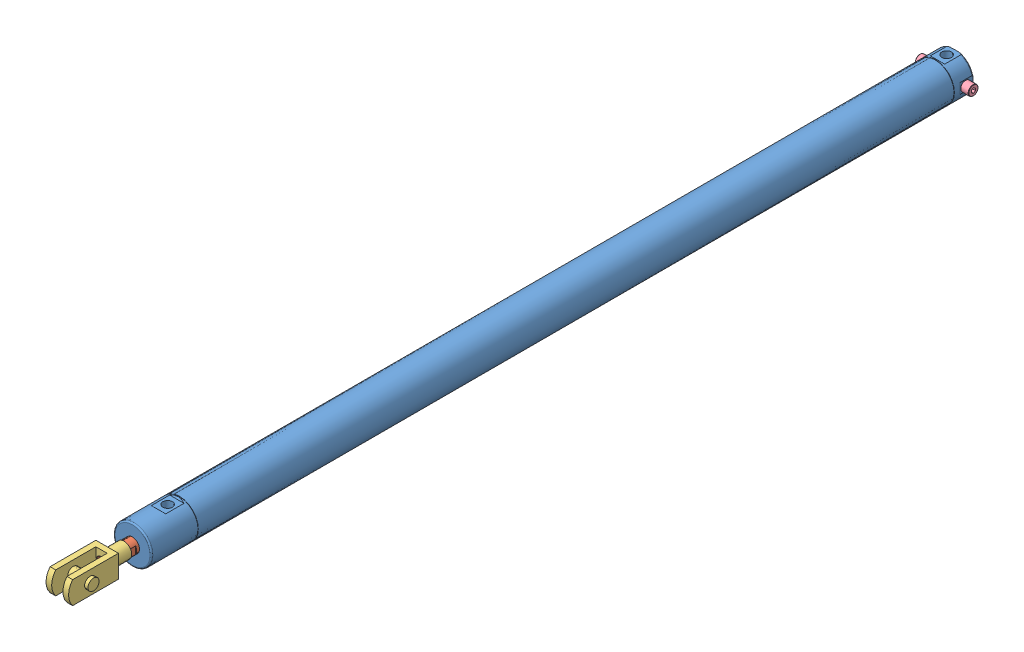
SolidWorks assembly KM-55051-M-1016+QM-55250-28+KQM-55451-25.SLDASM, configuration Default (file format 4700). Lengths in mm.
Overall size (76 54 1275.87).
5 component instances, 4 part files, 0 mates.
Components (placement in the parent):
- KM-55051-M-1016+QM-55250-28+KQM-55451-25_KM55-Body(50)-1: KM-55051-M-1016+QM-55250-28+KQM-55451-25_KM55-Body(50).sldasm [Default] x (0 0 -1) z (1 0 0) size (1169.08 54 54)
  - KM-55051-M-1016+QM-55250-28+KQM-55451-25_KM55-50(Default)-1: KM-55051-M-1016+QM-55250-28+KQM-55451-25_KM55-50(Default).sldprt [Default] at origin size (1169.08 54 54)
- KM-55051-M-1016+QM-55250-28+KQM-55451-25_KM55-Shaft(50)-1: KM-55051-M-1016+QM-55250-28+KQM-55451-25_KM55-Shaft(50).sldprt [Default] at (0 0 -537) x (-1 0 0) z (0 0 1) size (50 50 1184)
- KM-55051-M-1016+QM-55250-28+KQM-55451-25_KM55-Mount_F(QM805025)-1: KM-55051-M-1016+QM-55250-28+KQM-55451-25_KM55-Mount_F(QM805025).sldprt [Default] at (0 0 647) x (-1 0 0) z (0 -1 0) size (41.5 94.79 32)
- KM-55051-M-1016+QM-55250-28+KQM-55451-25_KM55-Mount_H(QM5525028)-1: KM-55051-M-1016+QM-55250-28+KQM-55451-25_KM55-Mount_H(QM5525028).sldprt [Default] at (0 0 -553) x (0 0 -1) z (1 0 0) size (14 14 76)
